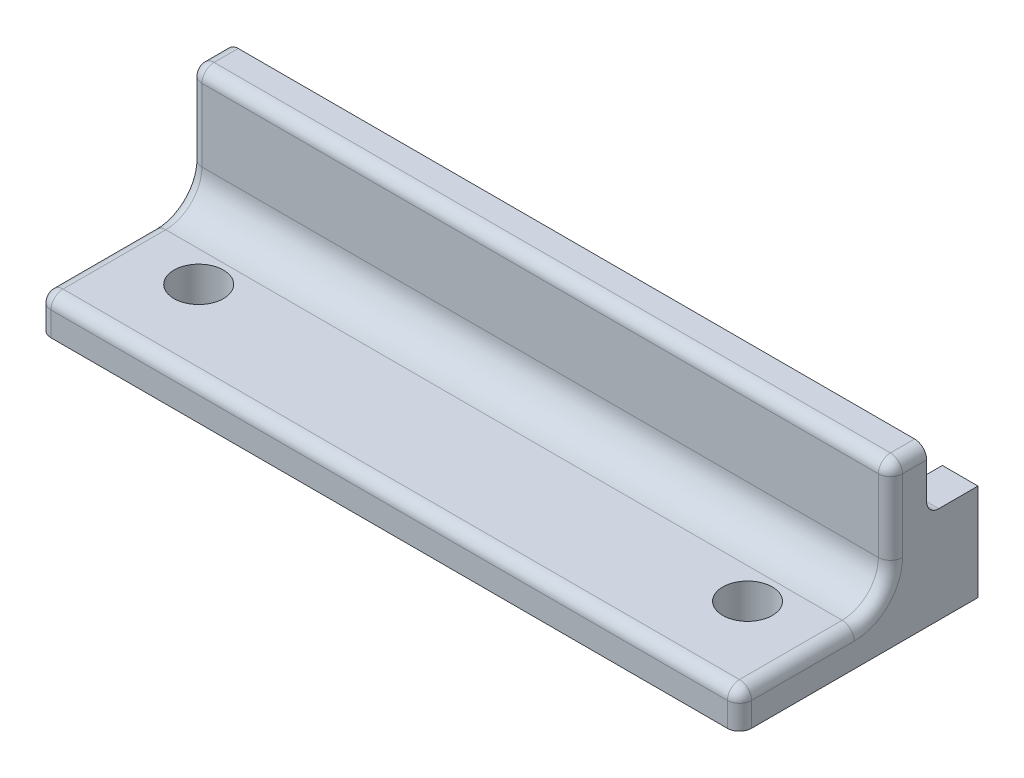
ISO-10303-21;
HEADER;
FILE_DESCRIPTION(('STEP AP214'),'2;1');
FILE_NAME('part.step','',(''),(''),'','','');
FILE_SCHEMA(('AUTOMOTIVE_DESIGN { 1 0 10303 214 1 1 1 1 }'));
ENDSEC;
DATA;
#1=APPLICATION_CONTEXT('core data for automotive mechanical design processes');
#2=APPLICATION_PROTOCOL_DEFINITION('international standard','automotive_design',2000,#1);
#3=PRODUCT_CONTEXT('',#1,'mechanical');
#4=PRODUCT('Part','Part','',(#3));
#5=PRODUCT_RELATED_PRODUCT_CATEGORY('part','',(#4));
#6=PRODUCT_DEFINITION_FORMATION('','',#4);
#7=PRODUCT_DEFINITION_CONTEXT('part definition',#1,'design');
#8=PRODUCT_DEFINITION('design','',#6,#7);
#9=PRODUCT_DEFINITION_SHAPE('','',#8);
#10=(LENGTH_UNIT() NAMED_UNIT(*) SI_UNIT(.MILLI.,.METRE.));
#11=(NAMED_UNIT(*) PLANE_ANGLE_UNIT() SI_UNIT($,.RADIAN.));
#12=(NAMED_UNIT(*) SI_UNIT($,.STERADIAN.) SOLID_ANGLE_UNIT());
#13=UNCERTAINTY_MEASURE_WITH_UNIT(LENGTH_MEASURE(1.E-05),#10,'distance_accuracy_value','');
#14=(GEOMETRIC_REPRESENTATION_CONTEXT(3) GLOBAL_UNCERTAINTY_ASSIGNED_CONTEXT((#13)) GLOBAL_UNIT_ASSIGNED_CONTEXT((#10,
#11,#12)) REPRESENTATION_CONTEXT('',''));
#15=CARTESIAN_POINT('',(0.,0.,0.));
#16=DIRECTION('',(0.,0.,1.));
#17=DIRECTION('',(1.,0.,0.));
#18=AXIS2_PLACEMENT_3D('',#15,#16,#17);
#19=CARTESIAN_POINT('',(46.400352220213,6.65930996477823,3.));
#20=DIRECTION('',(1.,0.,0.));
#21=DIRECTION('',(0.,1.,0.));
#22=AXIS2_PLACEMENT_3D('',#19,#20,#21);
#23=PLANE('',#22);
#24=DIRECTION('',(0.,-1.,0.));
#25=VECTOR('',#24,1.);
#26=CARTESIAN_POINT('',(46.400352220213,6.65930996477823,0.));
#27=LINE('',#26,#25);
#28=CARTESIAN_POINT('',(46.400352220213,5.65930996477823,0.));
#29=VERTEX_POINT('',#28);
#30=CARTESIAN_POINT('',(46.400352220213,2.65930996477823,0.));
#31=VERTEX_POINT('',#30);
#32=EDGE_CURVE('E306',#29,#31,#27,.T.);
#33=ORIENTED_EDGE('',*,*,#32,.F.);
#34=DIRECTION('',(0.,0.,-1.));
#35=VECTOR('',#34,1.);
#36=CARTESIAN_POINT('',(46.400352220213,5.65930996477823,2.));
#37=LINE('',#36,#35);
#38=CARTESIAN_POINT('',(46.400352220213,5.65930996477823,2.));
#39=VERTEX_POINT('',#38);
#40=EDGE_CURVE('E421',#29,#39,#37,.F.);
#41=ORIENTED_EDGE('',*,*,#40,.T.);
#42=DIRECTION('',(0.,-1.,0.));
#43=VECTOR('',#42,1.);
#44=CARTESIAN_POINT('',(46.400352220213,6.65930996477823,2.));
#45=LINE('',#44,#43);
#46=CARTESIAN_POINT('',(46.400352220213,-0.340690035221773,2.));
#47=VERTEX_POINT('',#46);
#48=EDGE_CURVE('E418',#39,#47,#45,.T.);
#49=ORIENTED_EDGE('',*,*,#48,.T.);
#50=CARTESIAN_POINT('',(46.400352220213,-0.340690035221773,6.));
#51=DIRECTION('',(1.,0.,0.));
#52=DIRECTION('',(0.,1.,0.));
#53=AXIS2_PLACEMENT_3D('',#50,#51,#52);
#54=CIRCLE('',#53,4.);
#55=CARTESIAN_POINT('',(46.400352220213,-4.34069003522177,6.));
#56=VERTEX_POINT('',#55);
#57=EDGE_CURVE('E415',#47,#56,#54,.F.);
#58=ORIENTED_EDGE('',*,*,#57,.T.);
#59=DIRECTION('',(0.,0.,1.));
#60=VECTOR('',#59,1.);
#61=CARTESIAN_POINT('',(46.400352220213,-4.34069003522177,14.5));
#62=LINE('',#61,#60);
#63=CARTESIAN_POINT('',(46.400352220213,-4.34069003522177,14.5));
#64=VERTEX_POINT('',#63);
#65=EDGE_CURVE('E409',#56,#64,#62,.T.);
#66=ORIENTED_EDGE('',*,*,#65,.T.);
#67=DIRECTION('',(0.,1.,0.));
#68=VECTOR('',#67,1.);
#69=CARTESIAN_POINT('',(46.400352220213,-6.34069003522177,14.5));
#70=LINE('',#69,#68);
#71=CARTESIAN_POINT('',(46.400352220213,-6.34069003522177,14.5));
#72=VERTEX_POINT('',#71);
#73=EDGE_CURVE('E412',#64,#72,#70,.F.);
#74=ORIENTED_EDGE('',*,*,#73,.T.);
#75=DIRECTION('',(0.,0.,1.));
#76=VECTOR('',#75,1.);
#77=CARTESIAN_POINT('',(46.400352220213,-6.34069003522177,0.));
#78=LINE('',#77,#76);
#79=CARTESIAN_POINT('',(46.400352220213,-6.34069003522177,-4.25000000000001));
#80=VERTEX_POINT('',#79);
#81=EDGE_CURVE('E282',#80,#72,#78,.T.);
#82=ORIENTED_EDGE('',*,*,#81,.F.);
#83=DIRECTION('',(0.,-1.,0.));
#84=VECTOR('',#83,1.);
#85=CARTESIAN_POINT('',(46.400352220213,1.65930996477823,-4.25000000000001));
#86=LINE('',#85,#84);
#87=CARTESIAN_POINT('',(46.400352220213,1.65930996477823,-4.25000000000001));
#88=VERTEX_POINT('',#87);
#89=EDGE_CURVE('E210',#88,#80,#86,.T.);
#90=ORIENTED_EDGE('',*,*,#89,.F.);
#91=DIRECTION('',(0.,0.,1.));
#92=VECTOR('',#91,1.);
#93=CARTESIAN_POINT('',(46.400352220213,1.65930996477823,0.));
#94=LINE('',#93,#92);
#95=CARTESIAN_POINT('',(46.400352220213,1.65930996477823,-1.));
#96=VERTEX_POINT('',#95);
#97=EDGE_CURVE('E211',#88,#96,#94,.T.);
#98=ORIENTED_EDGE('',*,*,#97,.T.);
#99=CARTESIAN_POINT('',(46.400352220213,2.65930996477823,-1.));
#100=DIRECTION('',(1.,0.,0.));
#101=DIRECTION('',(0.,1.,0.));
#102=AXIS2_PLACEMENT_3D('',#99,#100,#101);
#103=CIRCLE('',#102,1.);
#104=EDGE_CURVE('E11',#96,#31,#103,.F.);
#105=ORIENTED_EDGE('',*,*,#104,.T.);
#106=EDGE_LOOP('',(#33,#41,#49,#58,#66,#74,#82,#90,#98,#105));
#107=FACE_BOUND('',#106,.T.);
#108=ADVANCED_FACE('F41',(#107),#23,.T.);
#109=CARTESIAN_POINT('',(46.400352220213,6.65930996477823,3.));
#110=DIRECTION('',(0.,-1.,0.));
#111=DIRECTION('',(1.,0.,0.));
#112=AXIS2_PLACEMENT_3D('',#109,#110,#111);
#113=PLANE('',#112);
#114=DIRECTION('',(-1.,0.,0.));
#115=VECTOR('',#114,1.);
#116=CARTESIAN_POINT('',(46.400352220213,6.65930996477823,2.));
#117=LINE('',#116,#115);
#118=CARTESIAN_POINT('',(-10.599647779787,6.65930996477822,2.));
#119=VERTEX_POINT('',#118);
#120=CARTESIAN_POINT('',(45.400352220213,6.65930996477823,2.));
#121=VERTEX_POINT('',#120);
#122=EDGE_CURVE('E327',#119,#121,#117,.F.);
#123=ORIENTED_EDGE('',*,*,#122,.T.);
#124=DIRECTION('',(0.,0.,-1.));
#125=VECTOR('',#124,1.);
#126=CARTESIAN_POINT('',(45.400352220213,6.65930996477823,0.));
#127=LINE('',#126,#125);
#128=CARTESIAN_POINT('',(45.400352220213,6.65930996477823,0.));
#129=VERTEX_POINT('',#128);
#130=EDGE_CURVE('E379',#121,#129,#127,.T.);
#131=ORIENTED_EDGE('',*,*,#130,.T.);
#132=DIRECTION('',(-1.,0.,0.));
#133=VECTOR('',#132,1.);
#134=CARTESIAN_POINT('',(46.400352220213,6.65930996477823,0.));
#135=LINE('',#134,#133);
#136=CARTESIAN_POINT('',(-10.599647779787,6.65930996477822,0.));
#137=VERTEX_POINT('',#136);
#138=EDGE_CURVE('E303',#129,#137,#135,.T.);
#139=ORIENTED_EDGE('',*,*,#138,.T.);
#140=DIRECTION('',(0.,0.,-1.));
#141=VECTOR('',#140,1.);
#142=CARTESIAN_POINT('',(-10.599647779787,6.65930996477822,3.));
#143=LINE('',#142,#141);
#144=EDGE_CURVE('E362',#137,#119,#143,.F.);
#145=ORIENTED_EDGE('',*,*,#144,.T.);
#146=EDGE_LOOP('',(#123,#131,#139,#145));
#147=FACE_BOUND('',#146,.T.);
#148=ADVANCED_FACE('F571',(#147),#113,.F.);
#149=CARTESIAN_POINT('',(-11.599647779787,6.65930996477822,3.));
#150=DIRECTION('',(1.,0.,0.));
#151=DIRECTION('',(0.,0.,-1.));
#152=AXIS2_PLACEMENT_3D('',#149,#150,#151);
#153=PLANE('',#152);
#154=DIRECTION('',(0.,0.,-1.));
#155=VECTOR('',#154,1.);
#156=CARTESIAN_POINT('',(-11.599647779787,-6.34069003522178,0.));
#157=LINE('',#156,#155);
#158=CARTESIAN_POINT('',(-11.599647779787,-6.34069003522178,14.5));
#159=VERTEX_POINT('',#158);
#160=CARTESIAN_POINT('',(-11.599647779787,-6.34069003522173,-4.25000000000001));
#161=VERTEX_POINT('',#160);
#162=EDGE_CURVE('E292',#159,#161,#157,.T.);
#163=ORIENTED_EDGE('',*,*,#162,.F.);
#164=DIRECTION('',(0.,1.,0.));
#165=VECTOR('',#164,1.);
#166=CARTESIAN_POINT('',(-11.599647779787,6.65930996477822,14.5));
#167=LINE('',#166,#165);
#168=CARTESIAN_POINT('',(-11.599647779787,-4.34069003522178,14.5));
#169=VERTEX_POINT('',#168);
#170=EDGE_CURVE('E343',#159,#169,#167,.T.);
#171=ORIENTED_EDGE('',*,*,#170,.T.);
#172=DIRECTION('',(0.,0.,-1.));
#173=VECTOR('',#172,1.);
#174=CARTESIAN_POINT('',(-11.599647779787,-4.34069003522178,3.));
#175=LINE('',#174,#173);
#176=CARTESIAN_POINT('',(-11.599647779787,-4.34069003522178,6.));
#177=VERTEX_POINT('',#176);
#178=EDGE_CURVE('E331',#169,#177,#175,.T.);
#179=ORIENTED_EDGE('',*,*,#178,.T.);
#180=CARTESIAN_POINT('',(-11.599647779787,-0.340690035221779,6.));
#181=DIRECTION('',(1.,0.,0.));
#182=DIRECTION('',(0.,0.,-1.));
#183=AXIS2_PLACEMENT_3D('',#180,#181,#182);
#184=CIRCLE('',#183,4.);
#185=CARTESIAN_POINT('',(-11.599647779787,-0.340690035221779,2.));
#186=VERTEX_POINT('',#185);
#187=EDGE_CURVE('E334',#177,#186,#184,.T.);
#188=ORIENTED_EDGE('',*,*,#187,.T.);
#189=DIRECTION('',(0.,-1.,0.));
#190=VECTOR('',#189,1.);
#191=CARTESIAN_POINT('',(-11.599647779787,5.65930996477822,2.));
#192=LINE('',#191,#190);
#193=CARTESIAN_POINT('',(-11.599647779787,5.65930996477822,2.));
#194=VERTEX_POINT('',#193);
#195=EDGE_CURVE('E337',#186,#194,#192,.F.);
#196=ORIENTED_EDGE('',*,*,#195,.T.);
#197=DIRECTION('',(0.,0.,-1.));
#198=VECTOR('',#197,1.);
#199=CARTESIAN_POINT('',(-11.599647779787,5.65930996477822,3.));
#200=LINE('',#199,#198);
#201=CARTESIAN_POINT('',(-11.599647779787,5.65930996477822,0.));
#202=VERTEX_POINT('',#201);
#203=EDGE_CURVE('E340',#194,#202,#200,.T.);
#204=ORIENTED_EDGE('',*,*,#203,.T.);
#205=DIRECTION('',(0.,-1.,0.));
#206=VECTOR('',#205,1.);
#207=CARTESIAN_POINT('',(-11.599647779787,6.65930996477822,0.));
#208=LINE('',#207,#206);
#209=CARTESIAN_POINT('',(-11.599647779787,2.65930996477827,0.));
#210=VERTEX_POINT('',#209);
#211=EDGE_CURVE('E299',#202,#210,#208,.T.);
#212=ORIENTED_EDGE('',*,*,#211,.T.);
#213=CARTESIAN_POINT('',(-11.599647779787,2.65930996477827,-1.));
#214=DIRECTION('',(1.,0.,0.));
#215=DIRECTION('',(0.,0.,-1.));
#216=AXIS2_PLACEMENT_3D('',#213,#214,#215);
#217=CIRCLE('',#216,1.);
#218=CARTESIAN_POINT('',(-11.599647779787,1.65930996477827,-1.));
#219=VERTEX_POINT('',#218);
#220=EDGE_CURVE('E482',#210,#219,#217,.T.);
#221=ORIENTED_EDGE('',*,*,#220,.T.);
#222=DIRECTION('',(0.,0.,-1.));
#223=VECTOR('',#222,1.);
#224=CARTESIAN_POINT('',(-11.599647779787,1.65930996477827,0.));
#225=LINE('',#224,#223);
#226=CARTESIAN_POINT('',(-11.599647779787,1.65930996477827,-4.25000000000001));
#227=VERTEX_POINT('',#226);
#228=EDGE_CURVE('E235',#219,#227,#225,.T.);
#229=ORIENTED_EDGE('',*,*,#228,.T.);
#230=DIRECTION('',(0.,-1.,0.));
#231=VECTOR('',#230,1.);
#232=CARTESIAN_POINT('',(-11.599647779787,1.65930996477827,-4.25000000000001));
#233=LINE('',#232,#231);
#234=EDGE_CURVE('E253',#227,#161,#233,.T.);
#235=ORIENTED_EDGE('',*,*,#234,.T.);
#236=EDGE_LOOP('',(#163,#171,#179,#188,#196,#204,#212,#221,#229,#235));
#237=FACE_BOUND('',#236,.T.);
#238=ADVANCED_FACE('F521',(#237),#153,.F.);
#239=CARTESIAN_POINT('',(0.,0.,3.));
#240=DIRECTION('',(0.,0.,1.));
#241=DIRECTION('',(1.,0.,0.));
#242=AXIS2_PLACEMENT_3D('',#239,#240,#241);
#243=PLANE('',#242);
#244=DIRECTION('',(-1.,0.,0.));
#245=VECTOR('',#244,1.);
#246=CARTESIAN_POINT('',(0.,-0.340690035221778,3.));
#247=LINE('',#246,#245);
#248=CARTESIAN_POINT('',(-10.599647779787,-0.340690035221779,3.));
#249=VERTEX_POINT('',#248);
#250=CARTESIAN_POINT('',(45.400352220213,-0.340690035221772,3.));
#251=VERTEX_POINT('',#250);
#252=EDGE_CURVE('E313',#249,#251,#247,.F.);
#253=ORIENTED_EDGE('',*,*,#252,.T.);
#254=DIRECTION('',(0.,-1.,0.));
#255=VECTOR('',#254,1.);
#256=CARTESIAN_POINT('',(45.400352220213,0.,3.));
#257=LINE('',#256,#255);
#258=CARTESIAN_POINT('',(45.400352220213,5.65930996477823,3.));
#259=VERTEX_POINT('',#258);
#260=EDGE_CURVE('E427',#251,#259,#257,.F.);
#261=ORIENTED_EDGE('',*,*,#260,.T.);
#262=DIRECTION('',(-1.,0.,0.));
#263=VECTOR('',#262,1.);
#264=CARTESIAN_POINT('',(-11.599647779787,5.65930996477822,3.));
#265=LINE('',#264,#263);
#266=CARTESIAN_POINT('',(-10.599647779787,5.65930996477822,3.));
#267=VERTEX_POINT('',#266);
#268=EDGE_CURVE('E324',#259,#267,#265,.T.);
#269=ORIENTED_EDGE('',*,*,#268,.T.);
#270=DIRECTION('',(0.,-1.,0.));
#271=VECTOR('',#270,1.);
#272=CARTESIAN_POINT('',(-10.599647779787,-0.340690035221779,3.));
#273=LINE('',#272,#271);
#274=EDGE_CURVE('E369',#267,#249,#273,.T.);
#275=ORIENTED_EDGE('',*,*,#274,.T.);
#276=EDGE_LOOP('',(#253,#261,#269,#275));
#277=FACE_BOUND('',#276,.T.);
#278=ADVANCED_FACE('F615',(#277),#243,.T.);
#279=CARTESIAN_POINT('',(0.,0.,0.));
#280=DIRECTION('',(0.,0.,1.));
#281=DIRECTION('',(1.,0.,0.));
#282=AXIS2_PLACEMENT_3D('',#279,#280,#281);
#283=PLANE('',#282);
#284=CARTESIAN_POINT('',(-3.69964777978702,1.65930996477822,0.));
#285=DIRECTION('',(0.,0.,1.));
#286=DIRECTION('',(1.,0.,0.));
#287=AXIS2_PLACEMENT_3D('',#284,#285,#286);
#288=CIRCLE('',#287,1.2);
#289=CARTESIAN_POINT('',(-2.49964777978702,1.65930996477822,0.));
#290=VERTEX_POINT('',#289);
#291=EDGE_CURVE('E471',#290,#290,#288,.F.);
#292=ORIENTED_EDGE('',*,*,#291,.F.);
#293=EDGE_LOOP('',(#292));
#294=FACE_BOUND('',#293,.T.);
#295=CARTESIAN_POINT('',(38.500352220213,1.65930996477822,0.));
#296=DIRECTION('',(0.,0.,1.));
#297=DIRECTION('',(1.,0.,0.));
#298=AXIS2_PLACEMENT_3D('',#295,#296,#297);
#299=CIRCLE('',#298,1.2);
#300=CARTESIAN_POINT('',(39.700352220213,1.65930996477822,0.));
#301=VERTEX_POINT('',#300);
#302=EDGE_CURVE('E445',#301,#301,#299,.F.);
#303=ORIENTED_EDGE('',*,*,#302,.F.);
#304=EDGE_LOOP('',(#303));
#305=FACE_BOUND('',#304,.T.);
#306=ORIENTED_EDGE('',*,*,#32,.T.);
#307=DIRECTION('',(-1.,0.,0.));
#308=VECTOR('',#307,1.);
#309=CARTESIAN_POINT('',(43.450352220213,2.65930996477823,0.));
#310=LINE('',#309,#308);
#311=CARTESIAN_POINT('',(43.450352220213,2.65930996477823,0.));
#312=VERTEX_POINT('',#311);
#313=EDGE_CURVE('E489',#31,#312,#310,.T.);
#314=ORIENTED_EDGE('',*,*,#313,.T.);
#315=DIRECTION('',(0.,-1.,0.));
#316=VECTOR('',#315,1.);
#317=CARTESIAN_POINT('',(43.450352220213,1.65930996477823,0.));
#318=LINE('',#317,#316);
#319=CARTESIAN_POINT('',(43.450352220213,-6.34069003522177,0.));
#320=VERTEX_POINT('',#319);
#321=EDGE_CURVE('E224',#312,#320,#318,.T.);
#322=ORIENTED_EDGE('',*,*,#321,.T.);
#323=DIRECTION('',(1.,0.,0.));
#324=VECTOR('',#323,1.);
#325=CARTESIAN_POINT('',(46.400352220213,-6.34069003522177,0.));
#326=LINE('',#325,#324);
#327=CARTESIAN_POINT('',(-8.649647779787,-6.34069003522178,0.));
#328=VERTEX_POINT('',#327);
#329=EDGE_CURVE('E295',#328,#320,#326,.T.);
#330=ORIENTED_EDGE('',*,*,#329,.F.);
#331=DIRECTION('',(0.,-1.,0.));
#332=VECTOR('',#331,1.);
#333=CARTESIAN_POINT('',(-8.64964777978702,1.65930996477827,0.));
#334=LINE('',#333,#332);
#335=CARTESIAN_POINT('',(-8.64964777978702,2.65930996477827,0.));
#336=VERTEX_POINT('',#335);
#337=EDGE_CURVE('E243',#336,#328,#334,.T.);
#338=ORIENTED_EDGE('',*,*,#337,.F.);
#339=DIRECTION('',(-1.,0.,0.));
#340=VECTOR('',#339,1.);
#341=CARTESIAN_POINT('',(0.,2.65930996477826,0.));
#342=LINE('',#341,#340);
#343=EDGE_CURVE('E475',#336,#210,#342,.T.);
#344=ORIENTED_EDGE('',*,*,#343,.T.);
#345=ORIENTED_EDGE('',*,*,#211,.F.);
#346=CARTESIAN_POINT('',(-10.599647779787,5.65930996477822,0.));
#347=DIRECTION('',(0.,0.,1.));
#348=DIRECTION('',(1.,0.,0.));
#349=AXIS2_PLACEMENT_3D('',#346,#347,#348);
#350=CIRCLE('',#349,1.);
#351=EDGE_CURVE('E358',#202,#137,#350,.F.);
#352=ORIENTED_EDGE('',*,*,#351,.T.);
#353=ORIENTED_EDGE('',*,*,#138,.F.);
#354=CARTESIAN_POINT('',(45.400352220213,5.65930996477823,0.));
#355=DIRECTION('',(0.,0.,1.));
#356=DIRECTION('',(1.,0.,0.));
#357=AXIS2_PLACEMENT_3D('',#354,#355,#356);
#358=CIRCLE('',#357,1.);
#359=EDGE_CURVE('E406',#129,#29,#358,.F.);
#360=ORIENTED_EDGE('',*,*,#359,.T.);
#361=EDGE_LOOP('',(#306,#314,#322,#330,#338,#344,#345,#352,#353,#360));
#362=FACE_BOUND('',#361,.T.);
#363=ADVANCED_FACE('F497',(#294,#305,#362),#283,.F.);
#364=CARTESIAN_POINT('',(0.,-3.34069003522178,0.));
#365=DIRECTION('',(0.,-1.,0.));
#366=DIRECTION('',(1.,0.,0.));
#367=AXIS2_PLACEMENT_3D('',#364,#365,#366);
#368=PLANE('',#367);
#369=CARTESIAN_POINT('',(40.120352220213,-3.34069003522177,8.54895473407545));
#370=DIRECTION('',(0.,-1.,0.));
#371=DIRECTION('',(1.,0.,0.));
#372=AXIS2_PLACEMENT_3D('',#369,#370,#371);
#373=CIRCLE('',#372,2.05);
#374=CARTESIAN_POINT('',(42.170352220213,-3.34069003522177,8.54895473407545));
#375=VERTEX_POINT('',#374);
#376=EDGE_CURVE('E272',#375,#375,#373,.T.);
#377=ORIENTED_EDGE('',*,*,#376,.T.);
#378=EDGE_LOOP('',(#377));
#379=FACE_BOUND('',#378,.T.);
#380=CARTESIAN_POINT('',(-5.31964777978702,-3.34069003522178,8.54895473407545));
#381=DIRECTION('',(0.,-1.,0.));
#382=DIRECTION('',(1.,0.,0.));
#383=AXIS2_PLACEMENT_3D('',#380,#381,#382);
#384=CIRCLE('',#383,2.05);
#385=CARTESIAN_POINT('',(-3.26964777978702,-3.34069003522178,8.54895473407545));
#386=VERTEX_POINT('',#385);
#387=EDGE_CURVE('E273',#386,#386,#384,.T.);
#388=ORIENTED_EDGE('',*,*,#387,.T.);
#389=EDGE_LOOP('',(#388));
#390=FACE_BOUND('',#389,.T.);
#391=DIRECTION('',(-1.,0.,0.));
#392=VECTOR('',#391,1.);
#393=CARTESIAN_POINT('',(0.,-3.34069003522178,14.5));
#394=LINE('',#393,#392);
#395=CARTESIAN_POINT('',(-10.599647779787,-3.34069003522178,14.5));
#396=VERTEX_POINT('',#395);
#397=CARTESIAN_POINT('',(45.400352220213,-3.34069003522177,14.5));
#398=VERTEX_POINT('',#397);
#399=EDGE_CURVE('E320',#396,#398,#394,.F.);
#400=ORIENTED_EDGE('',*,*,#399,.T.);
#401=DIRECTION('',(0.,0.,1.));
#402=VECTOR('',#401,1.);
#403=CARTESIAN_POINT('',(45.400352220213,-3.34069003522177,6.));
#404=LINE('',#403,#402);
#405=CARTESIAN_POINT('',(45.400352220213,-3.34069003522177,6.));
#406=VERTEX_POINT('',#405);
#407=EDGE_CURVE('E442',#398,#406,#404,.F.);
#408=ORIENTED_EDGE('',*,*,#407,.T.);
#409=DIRECTION('',(-1.,0.,0.));
#410=VECTOR('',#409,1.);
#411=CARTESIAN_POINT('',(0.,-3.34069003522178,6.));
#412=LINE('',#411,#410);
#413=CARTESIAN_POINT('',(-10.599647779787,-3.34069003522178,6.));
#414=VERTEX_POINT('',#413);
#415=EDGE_CURVE('E310',#406,#414,#412,.T.);
#416=ORIENTED_EDGE('',*,*,#415,.T.);
#417=DIRECTION('',(0.,0.,-1.));
#418=VECTOR('',#417,1.);
#419=CARTESIAN_POINT('',(-10.599647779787,-3.34069003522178,0.));
#420=LINE('',#419,#418);
#421=EDGE_CURVE('E376',#414,#396,#420,.F.);
#422=ORIENTED_EDGE('',*,*,#421,.T.);
#423=EDGE_LOOP('',(#400,#408,#416,#422));
#424=FACE_BOUND('',#423,.T.);
#425=ADVANCED_FACE('F609',(#379,#390,#424),#368,.F.);
#426=CARTESIAN_POINT('',(0.,-6.34069003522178,0.));
#427=DIRECTION('',(0.,-1.,0.));
#428=DIRECTION('',(1.,0.,0.));
#429=AXIS2_PLACEMENT_3D('',#426,#427,#428);
#430=PLANE('',#429);
#431=CARTESIAN_POINT('',(40.120352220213,-6.34069003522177,8.54895473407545));
#432=DIRECTION('',(0.,-1.,0.));
#433=DIRECTION('',(1.,0.,0.));
#434=AXIS2_PLACEMENT_3D('',#431,#432,#433);
#435=CIRCLE('',#434,2.05);
#436=CARTESIAN_POINT('',(42.170352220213,-6.34069003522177,8.54895473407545));
#437=VERTEX_POINT('',#436);
#438=EDGE_CURVE('E278',#437,#437,#435,.T.);
#439=ORIENTED_EDGE('',*,*,#438,.F.);
#440=EDGE_LOOP('',(#439));
#441=FACE_BOUND('',#440,.T.);
#442=ORIENTED_EDGE('',*,*,#81,.T.);
#443=CARTESIAN_POINT('',(45.400352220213,-6.34069003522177,14.5));
#444=DIRECTION('',(0.,-1.,0.));
#445=DIRECTION('',(1.,0.,0.));
#446=AXIS2_PLACEMENT_3D('',#443,#444,#445);
#447=CIRCLE('',#446,1.);
#448=CARTESIAN_POINT('',(45.400352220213,-6.34069003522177,15.5));
#449=VERTEX_POINT('',#448);
#450=EDGE_CURVE('E436',#72,#449,#447,.T.);
#451=ORIENTED_EDGE('',*,*,#450,.T.);
#452=DIRECTION('',(-1.,0.,0.));
#453=VECTOR('',#452,1.);
#454=CARTESIAN_POINT('',(46.400352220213,-6.34069003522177,15.5));
#455=LINE('',#454,#453);
#456=CARTESIAN_POINT('',(-10.599647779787,-6.34069003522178,15.5));
#457=VERTEX_POINT('',#456);
#458=EDGE_CURVE('E289',#449,#457,#455,.T.);
#459=ORIENTED_EDGE('',*,*,#458,.T.);
#460=CARTESIAN_POINT('',(-10.599647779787,-6.34069003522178,14.5));
#461=DIRECTION('',(0.,-1.,0.));
#462=DIRECTION('',(1.,0.,0.));
#463=AXIS2_PLACEMENT_3D('',#460,#461,#462);
#464=CIRCLE('',#463,1.);
#465=EDGE_CURVE('E351',#457,#159,#464,.T.);
#466=ORIENTED_EDGE('',*,*,#465,.T.);
#467=ORIENTED_EDGE('',*,*,#162,.T.);
#468=DIRECTION('',(1.,0.,0.));
#469=VECTOR('',#468,1.);
#470=CARTESIAN_POINT('',(-8.64964777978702,-6.34069003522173,-4.25000000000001));
#471=LINE('',#470,#469);
#472=CARTESIAN_POINT('',(-8.64964777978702,-6.34069003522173,-4.25000000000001));
#473=VERTEX_POINT('',#472);
#474=EDGE_CURVE('E236',#161,#473,#471,.T.);
#475=ORIENTED_EDGE('',*,*,#474,.T.);
#476=DIRECTION('',(0.,0.,1.));
#477=VECTOR('',#476,1.);
#478=CARTESIAN_POINT('',(-8.64964777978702,-6.34069003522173,0.));
#479=LINE('',#478,#477);
#480=EDGE_CURVE('E228',#473,#328,#479,.T.);
#481=ORIENTED_EDGE('',*,*,#480,.T.);
#482=ORIENTED_EDGE('',*,*,#329,.T.);
#483=DIRECTION('',(0.,0.,-1.));
#484=VECTOR('',#483,1.);
#485=CARTESIAN_POINT('',(43.450352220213,-6.34069003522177,0.));
#486=LINE('',#485,#484);
#487=CARTESIAN_POINT('',(43.450352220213,-6.34069003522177,-4.25000000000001));
#488=VERTEX_POINT('',#487);
#489=EDGE_CURVE('E219',#320,#488,#486,.T.);
#490=ORIENTED_EDGE('',*,*,#489,.T.);
#491=DIRECTION('',(1.,0.,0.));
#492=VECTOR('',#491,1.);
#493=CARTESIAN_POINT('',(43.450352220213,-6.34069003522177,-4.25000000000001));
#494=LINE('',#493,#492);
#495=EDGE_CURVE('E201',#488,#80,#494,.T.);
#496=ORIENTED_EDGE('',*,*,#495,.T.);
#497=EDGE_LOOP('',(#442,#451,#459,#466,#467,#475,#481,#482,#490,#496));
#498=FACE_BOUND('',#497,.T.);
#499=CARTESIAN_POINT('',(-5.31964777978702,-6.34069003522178,8.54895473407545));
#500=DIRECTION('',(0.,-1.,0.));
#501=DIRECTION('',(1.,0.,0.));
#502=AXIS2_PLACEMENT_3D('',#499,#500,#501);
#503=CIRCLE('',#502,2.05);
#504=CARTESIAN_POINT('',(-3.26964777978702,-6.34069003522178,8.54895473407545));
#505=VERTEX_POINT('',#504);
#506=EDGE_CURVE('E268',#505,#505,#503,.T.);
#507=ORIENTED_EDGE('',*,*,#506,.F.);
#508=EDGE_LOOP('',(#507));
#509=FACE_BOUND('',#508,.T.);
#510=ADVANCED_FACE('F505',(#441,#498,#509),#430,.T.);
#511=CARTESIAN_POINT('',(46.400352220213,-6.34069003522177,15.5));
#512=DIRECTION('',(0.,0.,-1.));
#513=DIRECTION('',(-1.,0.,0.));
#514=AXIS2_PLACEMENT_3D('',#511,#512,#513);
#515=PLANE('',#514);
#516=ORIENTED_EDGE('',*,*,#458,.F.);
#517=DIRECTION('',(0.,1.,0.));
#518=VECTOR('',#517,1.);
#519=CARTESIAN_POINT('',(45.400352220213,-4.34069003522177,15.5));
#520=LINE('',#519,#518);
#521=CARTESIAN_POINT('',(45.400352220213,-4.34069003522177,15.5));
#522=VERTEX_POINT('',#521);
#523=EDGE_CURVE('E433',#449,#522,#520,.T.);
#524=ORIENTED_EDGE('',*,*,#523,.T.);
#525=DIRECTION('',(-1.,0.,0.));
#526=VECTOR('',#525,1.);
#527=CARTESIAN_POINT('',(46.400352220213,-4.34069003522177,15.5));
#528=LINE('',#527,#526);
#529=CARTESIAN_POINT('',(-10.599647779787,-4.34069003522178,15.5));
#530=VERTEX_POINT('',#529);
#531=EDGE_CURVE('E317',#522,#530,#528,.T.);
#532=ORIENTED_EDGE('',*,*,#531,.T.);
#533=DIRECTION('',(0.,1.,0.));
#534=VECTOR('',#533,1.);
#535=CARTESIAN_POINT('',(-10.599647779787,-6.34069003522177,15.5));
#536=LINE('',#535,#534);
#537=EDGE_CURVE('E347',#530,#457,#536,.F.);
#538=ORIENTED_EDGE('',*,*,#537,.T.);
#539=EDGE_LOOP('',(#516,#524,#532,#538));
#540=FACE_BOUND('',#539,.T.);
#541=ADVANCED_FACE('F603',(#540),#515,.F.);
#542=CARTESIAN_POINT('',(40.120352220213,-6.34069003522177,8.54895473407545));
#543=DIRECTION('',(0.,1.,0.));
#544=DIRECTION('',(-1.,0.,0.));
#545=AXIS2_PLACEMENT_3D('',#542,#543,#544);
#546=CYLINDRICAL_SURFACE('',#545,2.05);
#547=ORIENTED_EDGE('',*,*,#438,.T.);
#548=EDGE_LOOP('',(#547));
#549=FACE_BOUND('',#548,.T.);
#550=ORIENTED_EDGE('',*,*,#376,.F.);
#551=EDGE_LOOP('',(#550));
#552=FACE_BOUND('',#551,.T.);
#553=ADVANCED_FACE('F704',(#549,#552),#546,.F.);
#554=CARTESIAN_POINT('',(-5.31964777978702,-6.34069003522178,8.54895473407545));
#555=DIRECTION('',(0.,1.,0.));
#556=DIRECTION('',(-1.,0.,0.));
#557=AXIS2_PLACEMENT_3D('',#554,#555,#556);
#558=CYLINDRICAL_SURFACE('',#557,2.05);
#559=ORIENTED_EDGE('',*,*,#506,.T.);
#560=EDGE_LOOP('',(#559));
#561=FACE_BOUND('',#560,.T.);
#562=ORIENTED_EDGE('',*,*,#387,.F.);
#563=EDGE_LOOP('',(#562));
#564=FACE_BOUND('',#563,.T.);
#565=ADVANCED_FACE('F635',(#561,#564),#558,.F.);
#566=CARTESIAN_POINT('',(0.,-0.340690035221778,6.));
#567=DIRECTION('',(-1.,0.,0.));
#568=DIRECTION('',(0.,-1.,0.));
#569=AXIS2_PLACEMENT_3D('',#566,#567,#568);
#570=CYLINDRICAL_SURFACE('',#569,3.);
#571=ORIENTED_EDGE('',*,*,#415,.F.);
#572=CARTESIAN_POINT('',(45.400352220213,-0.340690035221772,6.));
#573=DIRECTION('',(1.,0.,0.));
#574=DIRECTION('',(0.,1.,0.));
#575=AXIS2_PLACEMENT_3D('',#572,#573,#574);
#576=CIRCLE('',#575,3.);
#577=EDGE_CURVE('E430',#406,#251,#576,.T.);
#578=ORIENTED_EDGE('',*,*,#577,.T.);
#579=ORIENTED_EDGE('',*,*,#252,.F.);
#580=CARTESIAN_POINT('',(-10.599647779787,-0.340690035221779,6.));
#581=DIRECTION('',(1.,0.,0.));
#582=DIRECTION('',(0.,0.,-1.));
#583=AXIS2_PLACEMENT_3D('',#580,#581,#582);
#584=CIRCLE('',#583,3.);
#585=EDGE_CURVE('E372',#249,#414,#584,.F.);
#586=ORIENTED_EDGE('',*,*,#585,.T.);
#587=EDGE_LOOP('',(#571,#578,#579,#586));
#588=FACE_BOUND('',#587,.T.);
#589=ADVANCED_FACE('F613',(#588),#570,.F.);
#590=CARTESIAN_POINT('',(46.400352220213,-4.34069003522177,14.5));
#591=DIRECTION('',(-1.,0.,0.));
#592=DIRECTION('',(0.,-1.,0.));
#593=AXIS2_PLACEMENT_3D('',#590,#591,#592);
#594=CYLINDRICAL_SURFACE('',#593,1.);
#595=ORIENTED_EDGE('',*,*,#531,.F.);
#596=CARTESIAN_POINT('',(45.400352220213,-4.34069003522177,14.5));
#597=DIRECTION('',(-1.,0.,0.));
#598=DIRECTION('',(0.,-1.,0.));
#599=AXIS2_PLACEMENT_3D('',#596,#597,#598);
#600=CIRCLE('',#599,1.);
#601=EDGE_CURVE('E439',#522,#398,#600,.T.);
#602=ORIENTED_EDGE('',*,*,#601,.T.);
#603=ORIENTED_EDGE('',*,*,#399,.F.);
#604=CARTESIAN_POINT('',(-10.599647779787,-4.34069003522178,14.5));
#605=DIRECTION('',(-1.,0.,0.));
#606=DIRECTION('',(0.,-1.,0.));
#607=AXIS2_PLACEMENT_3D('',#604,#605,#606);
#608=CIRCLE('',#607,1.);
#609=EDGE_CURVE('E354',#396,#530,#608,.F.);
#610=ORIENTED_EDGE('',*,*,#609,.T.);
#611=EDGE_LOOP('',(#595,#602,#603,#610));
#612=FACE_BOUND('',#611,.T.);
#613=ADVANCED_FACE('F607',(#612),#594,.T.);
#614=CARTESIAN_POINT('',(0.,5.65930996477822,2.));
#615=DIRECTION('',(1.,0.,0.));
#616=DIRECTION('',(0.,1.,0.));
#617=AXIS2_PLACEMENT_3D('',#614,#615,#616);
#618=CYLINDRICAL_SURFACE('',#617,1.);
#619=ORIENTED_EDGE('',*,*,#268,.F.);
#620=CARTESIAN_POINT('',(45.400352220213,5.65930996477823,2.));
#621=DIRECTION('',(1.,0.,0.));
#622=DIRECTION('',(0.,1.,0.));
#623=AXIS2_PLACEMENT_3D('',#620,#621,#622);
#624=CIRCLE('',#623,1.);
#625=EDGE_CURVE('E424',#259,#121,#624,.F.);
#626=ORIENTED_EDGE('',*,*,#625,.T.);
#627=ORIENTED_EDGE('',*,*,#122,.F.);
#628=CARTESIAN_POINT('',(-10.599647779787,5.65930996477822,2.));
#629=DIRECTION('',(1.,0.,0.));
#630=DIRECTION('',(0.,1.,0.));
#631=AXIS2_PLACEMENT_3D('',#628,#629,#630);
#632=CIRCLE('',#631,1.);
#633=EDGE_CURVE('E365',#119,#267,#632,.T.);
#634=ORIENTED_EDGE('',*,*,#633,.T.);
#635=EDGE_LOOP('',(#619,#626,#627,#634));
#636=FACE_BOUND('',#635,.T.);
#637=ADVANCED_FACE('F566',(#636),#618,.T.);
#638=CARTESIAN_POINT('',(-10.599647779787,5.65930996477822,3.));
#639=DIRECTION('',(0.,0.,-1.));
#640=DIRECTION('',(-1.,0.,0.));
#641=AXIS2_PLACEMENT_3D('',#638,#639,#640);
#642=CYLINDRICAL_SURFACE('',#641,1.);
#643=CARTESIAN_POINT('',(-10.599647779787,5.65930996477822,2.));
#644=DIRECTION('',(0.,0.,1.));
#645=DIRECTION('',(1.,0.,0.));
#646=AXIS2_PLACEMENT_3D('',#643,#644,#645);
#647=CIRCLE('',#646,1.);
#648=EDGE_CURVE('E277',#119,#194,#647,.T.);
#649=ORIENTED_EDGE('',*,*,#648,.F.);
#650=ORIENTED_EDGE('',*,*,#144,.F.);
#651=ORIENTED_EDGE('',*,*,#351,.F.);
#652=ORIENTED_EDGE('',*,*,#203,.F.);
#653=EDGE_LOOP('',(#649,#650,#651,#652));
#654=FACE_BOUND('',#653,.T.);
#655=ADVANCED_FACE('F558',(#654),#642,.T.);
#656=CARTESIAN_POINT('',(-10.599647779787,5.65930996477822,2.));
#657=DIRECTION('',(1.,0.,0.));
#658=DIRECTION('',(0.,0.,-1.));
#659=AXIS2_PLACEMENT_3D('',#656,#657,#658);
#660=SPHERICAL_SURFACE('',#659,1.);
#661=ORIENTED_EDGE('',*,*,#633,.F.);
#662=ORIENTED_EDGE('',*,*,#648,.T.);
#663=CARTESIAN_POINT('',(-10.599647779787,5.65930996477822,2.));
#664=DIRECTION('',(0.,-1.,0.));
#665=DIRECTION('',(0.,0.,-1.));
#666=AXIS2_PLACEMENT_3D('',#663,#664,#665);
#667=CIRCLE('',#666,1.);
#668=EDGE_CURVE('E396',#267,#194,#667,.T.);
#669=ORIENTED_EDGE('',*,*,#668,.F.);
#670=EDGE_LOOP('',(#661,#662,#669));
#671=FACE_BOUND('',#670,.T.);
#672=ADVANCED_FACE('F562',(#671),#660,.T.);
#673=CARTESIAN_POINT('',(-10.599647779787,0.,2.));
#674=DIRECTION('',(0.,1.,0.));
#675=DIRECTION('',(0.,0.,1.));
#676=AXIS2_PLACEMENT_3D('',#673,#674,#675);
#677=CYLINDRICAL_SURFACE('',#676,1.);
#678=ORIENTED_EDGE('',*,*,#668,.T.);
#679=ORIENTED_EDGE('',*,*,#195,.F.);
#680=CARTESIAN_POINT('',(-10.599647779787,-0.340690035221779,2.));
#681=DIRECTION('',(0.,-1.,0.));
#682=DIRECTION('',(0.,0.,-1.));
#683=AXIS2_PLACEMENT_3D('',#680,#681,#682);
#684=CIRCLE('',#683,1.);
#685=EDGE_CURVE('E392',#249,#186,#684,.T.);
#686=ORIENTED_EDGE('',*,*,#685,.F.);
#687=ORIENTED_EDGE('',*,*,#274,.F.);
#688=EDGE_LOOP('',(#678,#679,#686,#687));
#689=FACE_BOUND('',#688,.T.);
#690=ADVANCED_FACE('F552',(#689),#677,.T.);
#691=CARTESIAN_POINT('',(-10.599647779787,-0.340690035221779,6.));
#692=DIRECTION('',(1.,0.,0.));
#693=DIRECTION('',(0.,0.,-1.));
#694=AXIS2_PLACEMENT_3D('',#691,#692,#693);
#695=TOROIDAL_SURFACE('',#694,4.,1.);
#696=ORIENTED_EDGE('',*,*,#685,.T.);
#697=ORIENTED_EDGE('',*,*,#187,.F.);
#698=CARTESIAN_POINT('',(-10.599647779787,-4.34069003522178,6.));
#699=DIRECTION('',(0.,0.,1.));
#700=DIRECTION('',(1.,0.,0.));
#701=AXIS2_PLACEMENT_3D('',#698,#699,#700);
#702=CIRCLE('',#701,1.);
#703=EDGE_CURVE('E388',#414,#177,#702,.T.);
#704=ORIENTED_EDGE('',*,*,#703,.F.);
#705=ORIENTED_EDGE('',*,*,#585,.F.);
#706=EDGE_LOOP('',(#696,#697,#704,#705));
#707=FACE_BOUND('',#706,.T.);
#708=ADVANCED_FACE('F547',(#707),#695,.T.);
#709=CARTESIAN_POINT('',(-10.599647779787,-4.34069003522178,3.));
#710=DIRECTION('',(0.,0.,-1.));
#711=DIRECTION('',(-1.,0.,0.));
#712=AXIS2_PLACEMENT_3D('',#709,#710,#711);
#713=CYLINDRICAL_SURFACE('',#712,1.);
#714=CARTESIAN_POINT('',(-10.599647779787,-4.34069003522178,14.5));
#715=DIRECTION('',(0.,0.,1.));
#716=DIRECTION('',(1.,0.,0.));
#717=AXIS2_PLACEMENT_3D('',#714,#715,#716);
#718=CIRCLE('',#717,1.);
#719=EDGE_CURVE('E383',#396,#169,#718,.T.);
#720=ORIENTED_EDGE('',*,*,#719,.F.);
#721=ORIENTED_EDGE('',*,*,#421,.F.);
#722=ORIENTED_EDGE('',*,*,#703,.T.);
#723=ORIENTED_EDGE('',*,*,#178,.F.);
#724=EDGE_LOOP('',(#720,#721,#722,#723));
#725=FACE_BOUND('',#724,.T.);
#726=ADVANCED_FACE('F542',(#725),#713,.T.);
#727=CARTESIAN_POINT('',(-10.599647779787,-4.34069003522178,14.5));
#728=DIRECTION('',(1.,0.,0.));
#729=DIRECTION('',(0.,0.,-1.));
#730=AXIS2_PLACEMENT_3D('',#727,#728,#729);
#731=SPHERICAL_SURFACE('',#730,1.);
#732=ORIENTED_EDGE('',*,*,#609,.F.);
#733=ORIENTED_EDGE('',*,*,#719,.T.);
#734=CARTESIAN_POINT('',(-10.599647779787,-4.34069003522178,14.5));
#735=DIRECTION('',(0.,-1.,0.));
#736=DIRECTION('',(0.,0.,-1.));
#737=AXIS2_PLACEMENT_3D('',#734,#735,#736);
#738=CIRCLE('',#737,1.);
#739=EDGE_CURVE('E380',#530,#169,#738,.T.);
#740=ORIENTED_EDGE('',*,*,#739,.F.);
#741=EDGE_LOOP('',(#732,#733,#740));
#742=FACE_BOUND('',#741,.T.);
#743=ADVANCED_FACE('F539',(#742),#731,.T.);
#744=CARTESIAN_POINT('',(-10.599647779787,6.65930996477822,14.5));
#745=DIRECTION('',(0.,1.,0.));
#746=DIRECTION('',(0.,0.,1.));
#747=AXIS2_PLACEMENT_3D('',#744,#745,#746);
#748=CYLINDRICAL_SURFACE('',#747,1.);
#749=ORIENTED_EDGE('',*,*,#465,.F.);
#750=ORIENTED_EDGE('',*,*,#537,.F.);
#751=ORIENTED_EDGE('',*,*,#739,.T.);
#752=ORIENTED_EDGE('',*,*,#170,.F.);
#753=EDGE_LOOP('',(#749,#750,#751,#752));
#754=FACE_BOUND('',#753,.T.);
#755=ADVANCED_FACE('F532',(#754),#748,.T.);
#756=CARTESIAN_POINT('',(45.400352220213,-6.34069003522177,14.5));
#757=DIRECTION('',(0.,-1.,0.));
#758=DIRECTION('',(1.,0.,0.));
#759=AXIS2_PLACEMENT_3D('',#756,#757,#758);
#760=CYLINDRICAL_SURFACE('',#759,1.);
#761=CARTESIAN_POINT('',(45.400352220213,-4.34069003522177,14.5));
#762=DIRECTION('',(0.,1.,0.));
#763=DIRECTION('',(-1.,0.,0.));
#764=AXIS2_PLACEMENT_3D('',#761,#762,#763);
#765=CIRCLE('',#764,1.);
#766=EDGE_CURVE('E384',#522,#64,#765,.T.);
#767=ORIENTED_EDGE('',*,*,#766,.F.);
#768=ORIENTED_EDGE('',*,*,#523,.F.);
#769=ORIENTED_EDGE('',*,*,#450,.F.);
#770=ORIENTED_EDGE('',*,*,#73,.F.);
#771=EDGE_LOOP('',(#767,#768,#769,#770));
#772=FACE_BOUND('',#771,.T.);
#773=ADVANCED_FACE('F600',(#772),#760,.T.);
#774=CARTESIAN_POINT('',(45.400352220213,-4.34069003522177,14.5));
#775=DIRECTION('',(1.,0.,0.));
#776=DIRECTION('',(0.,1.,0.));
#777=AXIS2_PLACEMENT_3D('',#774,#775,#776);
#778=SPHERICAL_SURFACE('',#777,1.);
#779=ORIENTED_EDGE('',*,*,#601,.F.);
#780=ORIENTED_EDGE('',*,*,#766,.T.);
#781=CARTESIAN_POINT('',(45.400352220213,-4.34069003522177,14.5));
#782=DIRECTION('',(0.,0.,-1.));
#783=DIRECTION('',(-1.,0.,0.));
#784=AXIS2_PLACEMENT_3D('',#781,#782,#783);
#785=CIRCLE('',#784,1.);
#786=EDGE_CURVE('E461',#398,#64,#785,.T.);
#787=ORIENTED_EDGE('',*,*,#786,.F.);
#788=EDGE_LOOP('',(#779,#780,#787));
#789=FACE_BOUND('',#788,.T.);
#790=ADVANCED_FACE('F596',(#789),#778,.T.);
#791=CARTESIAN_POINT('',(45.400352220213,-4.34069003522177,3.));
#792=DIRECTION('',(0.,0.,-1.));
#793=DIRECTION('',(-1.,0.,0.));
#794=AXIS2_PLACEMENT_3D('',#791,#792,#793);
#795=CYLINDRICAL_SURFACE('',#794,1.);
#796=ORIENTED_EDGE('',*,*,#786,.T.);
#797=ORIENTED_EDGE('',*,*,#65,.F.);
#798=CARTESIAN_POINT('',(45.400352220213,-4.34069003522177,6.));
#799=DIRECTION('',(0.,0.,-1.));
#800=DIRECTION('',(-1.,0.,0.));
#801=AXIS2_PLACEMENT_3D('',#798,#799,#800);
#802=CIRCLE('',#801,1.);
#803=EDGE_CURVE('E457',#406,#56,#802,.T.);
#804=ORIENTED_EDGE('',*,*,#803,.F.);
#805=ORIENTED_EDGE('',*,*,#407,.F.);
#806=EDGE_LOOP('',(#796,#797,#804,#805));
#807=FACE_BOUND('',#806,.T.);
#808=ADVANCED_FACE('F591',(#807),#795,.T.);
#809=CARTESIAN_POINT('',(45.400352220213,-0.340690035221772,6.));
#810=DIRECTION('',(1.,0.,0.));
#811=DIRECTION('',(0.,1.,0.));
#812=AXIS2_PLACEMENT_3D('',#809,#810,#811);
#813=TOROIDAL_SURFACE('',#812,4.,1.);
#814=ORIENTED_EDGE('',*,*,#803,.T.);
#815=ORIENTED_EDGE('',*,*,#57,.F.);
#816=CARTESIAN_POINT('',(45.400352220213,-0.340690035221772,2.));
#817=DIRECTION('',(0.,1.,0.));
#818=DIRECTION('',(-1.,0.,0.));
#819=AXIS2_PLACEMENT_3D('',#816,#817,#818);
#820=CIRCLE('',#819,1.);
#821=EDGE_CURVE('E453',#251,#47,#820,.T.);
#822=ORIENTED_EDGE('',*,*,#821,.F.);
#823=ORIENTED_EDGE('',*,*,#577,.F.);
#824=EDGE_LOOP('',(#814,#815,#822,#823));
#825=FACE_BOUND('',#824,.T.);
#826=ADVANCED_FACE('F586',(#825),#813,.T.);
#827=CARTESIAN_POINT('',(45.400352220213,6.65930996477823,2.));
#828=DIRECTION('',(0.,-1.,0.));
#829=DIRECTION('',(1.,0.,0.));
#830=AXIS2_PLACEMENT_3D('',#827,#828,#829);
#831=CYLINDRICAL_SURFACE('',#830,1.);
#832=CARTESIAN_POINT('',(45.400352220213,5.65930996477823,2.));
#833=DIRECTION('',(0.,1.,0.));
#834=DIRECTION('',(-1.,0.,0.));
#835=AXIS2_PLACEMENT_3D('',#832,#833,#834);
#836=CIRCLE('',#835,1.);
#837=EDGE_CURVE('E449',#259,#39,#836,.T.);
#838=ORIENTED_EDGE('',*,*,#837,.F.);
#839=ORIENTED_EDGE('',*,*,#260,.F.);
#840=ORIENTED_EDGE('',*,*,#821,.T.);
#841=ORIENTED_EDGE('',*,*,#48,.F.);
#842=EDGE_LOOP('',(#838,#839,#840,#841));
#843=FACE_BOUND('',#842,.T.);
#844=ADVANCED_FACE('F581',(#843),#831,.T.);
#845=CARTESIAN_POINT('',(45.400352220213,5.65930996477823,2.));
#846=DIRECTION('',(1.,0.,0.));
#847=DIRECTION('',(0.,1.,0.));
#848=AXIS2_PLACEMENT_3D('',#845,#846,#847);
#849=SPHERICAL_SURFACE('',#848,1.);
#850=ORIENTED_EDGE('',*,*,#625,.F.);
#851=ORIENTED_EDGE('',*,*,#837,.T.);
#852=CARTESIAN_POINT('',(45.400352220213,5.65930996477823,2.));
#853=DIRECTION('',(0.,0.,-1.));
#854=DIRECTION('',(-1.,0.,0.));
#855=AXIS2_PLACEMENT_3D('',#852,#853,#854);
#856=CIRCLE('',#855,1.);
#857=EDGE_CURVE('E267',#121,#39,#856,.T.);
#858=ORIENTED_EDGE('',*,*,#857,.F.);
#859=EDGE_LOOP('',(#850,#851,#858));
#860=FACE_BOUND('',#859,.T.);
#861=ADVANCED_FACE('F575',(#860),#849,.T.);
#862=CARTESIAN_POINT('',(45.400352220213,5.65930996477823,3.));
#863=DIRECTION('',(0.,0.,1.));
#864=DIRECTION('',(1.,0.,0.));
#865=AXIS2_PLACEMENT_3D('',#862,#863,#864);
#866=CYLINDRICAL_SURFACE('',#865,1.);
#867=ORIENTED_EDGE('',*,*,#857,.T.);
#868=ORIENTED_EDGE('',*,*,#40,.F.);
#869=ORIENTED_EDGE('',*,*,#359,.F.);
#870=ORIENTED_EDGE('',*,*,#130,.F.);
#871=EDGE_LOOP('',(#867,#868,#869,#870));
#872=FACE_BOUND('',#871,.T.);
#873=ADVANCED_FACE('F577',(#872),#866,.T.);
#874=CARTESIAN_POINT('',(38.500352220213,1.65930996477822,-3.));
#875=DIRECTION('',(0.,0.,1.));
#876=DIRECTION('',(1.,0.,0.));
#877=AXIS2_PLACEMENT_3D('',#874,#875,#876);
#878=CYLINDRICAL_SURFACE('',#877,1.2);
#879=CARTESIAN_POINT('',(38.500352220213,1.65930996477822,-3.));
#880=DIRECTION('',(0.,0.,-1.));
#881=DIRECTION('',(-1.,0.,0.));
#882=AXIS2_PLACEMENT_3D('',#879,#880,#881);
#883=CIRCLE('',#882,1.2);
#884=CARTESIAN_POINT('',(37.300352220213,1.65930996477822,-3.));
#885=VERTEX_POINT('',#884);
#886=EDGE_CURVE('E263',#885,#885,#883,.T.);
#887=ORIENTED_EDGE('',*,*,#886,.F.);
#888=EDGE_LOOP('',(#887));
#889=FACE_BOUND('',#888,.T.);
#890=ORIENTED_EDGE('',*,*,#302,.T.);
#891=EDGE_LOOP('',(#890));
#892=FACE_BOUND('',#891,.T.);
#893=ADVANCED_FACE('F656',(#889,#892),#878,.T.);
#894=CARTESIAN_POINT('',(38.500352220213,1.65930996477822,-3.));
#895=DIRECTION('',(0.,0.,-1.));
#896=DIRECTION('',(-1.,0.,0.));
#897=AXIS2_PLACEMENT_3D('',#894,#895,#896);
#898=PLANE('',#897);
#899=ORIENTED_EDGE('',*,*,#886,.T.);
#900=EDGE_LOOP('',(#899));
#901=FACE_BOUND('',#900,.T.);
#902=ADVANCED_FACE('F694',(#901),#898,.T.);
#903=CARTESIAN_POINT('',(-3.69964777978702,1.65930996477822,-3.));
#904=DIRECTION('',(0.,0.,1.));
#905=DIRECTION('',(1.,0.,0.));
#906=AXIS2_PLACEMENT_3D('',#903,#904,#905);
#907=CYLINDRICAL_SURFACE('',#906,1.2);
#908=CARTESIAN_POINT('',(-3.69964777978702,1.65930996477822,-3.));
#909=DIRECTION('',(0.,0.,-1.));
#910=DIRECTION('',(-1.,0.,0.));
#911=AXIS2_PLACEMENT_3D('',#908,#909,#910);
#912=CIRCLE('',#911,1.2);
#913=CARTESIAN_POINT('',(-4.89964777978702,1.65930996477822,-3.));
#914=VERTEX_POINT('',#913);
#915=EDGE_CURVE('E252',#914,#914,#912,.T.);
#916=ORIENTED_EDGE('',*,*,#915,.F.);
#917=EDGE_LOOP('',(#916));
#918=FACE_BOUND('',#917,.T.);
#919=ORIENTED_EDGE('',*,*,#291,.T.);
#920=EDGE_LOOP('',(#919));
#921=FACE_BOUND('',#920,.T.);
#922=ADVANCED_FACE('F690',(#918,#921),#907,.T.);
#923=CARTESIAN_POINT('',(-3.69964777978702,1.65930996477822,-3.));
#924=DIRECTION('',(0.,0.,-1.));
#925=DIRECTION('',(-1.,0.,0.));
#926=AXIS2_PLACEMENT_3D('',#923,#924,#925);
#927=PLANE('',#926);
#928=ORIENTED_EDGE('',*,*,#915,.T.);
#929=EDGE_LOOP('',(#928));
#930=FACE_BOUND('',#929,.T.);
#931=ADVANCED_FACE('F687',(#930),#927,.T.);
#932=CARTESIAN_POINT('',(-8.64964777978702,1.65930996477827,0.));
#933=DIRECTION('',(1.,0.,0.));
#934=DIRECTION('',(0.,1.,0.));
#935=AXIS2_PLACEMENT_3D('',#932,#933,#934);
#936=PLANE('',#935);
#937=ORIENTED_EDGE('',*,*,#480,.F.);
#938=DIRECTION('',(0.,-1.,0.));
#939=VECTOR('',#938,1.);
#940=CARTESIAN_POINT('',(-8.64964777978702,1.65930996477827,-4.25000000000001));
#941=LINE('',#940,#939);
#942=CARTESIAN_POINT('',(-8.64964777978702,1.65930996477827,-4.25000000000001));
#943=VERTEX_POINT('',#942);
#944=EDGE_CURVE('E249',#943,#473,#941,.T.);
#945=ORIENTED_EDGE('',*,*,#944,.F.);
#946=DIRECTION('',(0.,0.,1.));
#947=VECTOR('',#946,1.);
#948=CARTESIAN_POINT('',(-8.64964777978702,1.65930996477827,0.));
#949=LINE('',#948,#947);
#950=CARTESIAN_POINT('',(-8.64964777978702,1.65930996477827,-1.));
#951=VERTEX_POINT('',#950);
#952=EDGE_CURVE('E231',#943,#951,#949,.T.);
#953=ORIENTED_EDGE('',*,*,#952,.T.);
#954=CARTESIAN_POINT('',(-8.64964777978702,2.65930996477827,-1.));
#955=DIRECTION('',(1.,0.,0.));
#956=DIRECTION('',(0.,1.,0.));
#957=AXIS2_PLACEMENT_3D('',#954,#955,#956);
#958=CIRCLE('',#957,1.);
#959=EDGE_CURVE('E485',#951,#336,#958,.F.);
#960=ORIENTED_EDGE('',*,*,#959,.T.);
#961=ORIENTED_EDGE('',*,*,#337,.T.);
#962=EDGE_LOOP('',(#937,#945,#953,#960,#961));
#963=FACE_BOUND('',#962,.T.);
#964=ADVANCED_FACE('F513',(#963),#936,.T.);
#965=CARTESIAN_POINT('',(-8.64964777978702,1.65930996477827,-4.25000000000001));
#966=DIRECTION('',(0.,0.,-1.));
#967=DIRECTION('',(-1.,0.,0.));
#968=AXIS2_PLACEMENT_3D('',#965,#966,#967);
#969=PLANE('',#968);
#970=ORIENTED_EDGE('',*,*,#474,.F.);
#971=ORIENTED_EDGE('',*,*,#234,.F.);
#972=DIRECTION('',(1.,0.,0.));
#973=VECTOR('',#972,1.);
#974=CARTESIAN_POINT('',(-8.64964777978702,1.65930996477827,-4.25000000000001));
#975=LINE('',#974,#973);
#976=EDGE_CURVE('E239',#227,#943,#975,.T.);
#977=ORIENTED_EDGE('',*,*,#976,.T.);
#978=ORIENTED_EDGE('',*,*,#944,.T.);
#979=EDGE_LOOP('',(#970,#971,#977,#978));
#980=FACE_BOUND('',#979,.T.);
#981=ADVANCED_FACE('F528',(#980),#969,.T.);
#982=CARTESIAN_POINT('',(0.,1.65930996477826,0.));
#983=DIRECTION('',(0.,1.,0.));
#984=DIRECTION('',(-1.,0.,0.));
#985=AXIS2_PLACEMENT_3D('',#982,#983,#984);
#986=PLANE('',#985);
#987=ORIENTED_EDGE('',*,*,#228,.F.);
#988=DIRECTION('',(-1.,0.,0.));
#989=VECTOR('',#988,1.);
#990=CARTESIAN_POINT('',(0.,1.65930996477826,-1.));
#991=LINE('',#990,#989);
#992=EDGE_CURVE('E479',#219,#951,#991,.F.);
#993=ORIENTED_EDGE('',*,*,#992,.T.);
#994=ORIENTED_EDGE('',*,*,#952,.F.);
#995=ORIENTED_EDGE('',*,*,#976,.F.);
#996=EDGE_LOOP('',(#987,#993,#994,#995));
#997=FACE_BOUND('',#996,.T.);
#998=ADVANCED_FACE('F525',(#997),#986,.T.);
#999=CARTESIAN_POINT('',(43.450352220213,1.65930996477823,0.));
#1000=DIRECTION('',(-1.,0.,0.));
#1001=DIRECTION('',(0.,-1.,0.));
#1002=AXIS2_PLACEMENT_3D('',#999,#1000,#1001);
#1003=PLANE('',#1002);
#1004=ORIENTED_EDGE('',*,*,#489,.F.);
#1005=ORIENTED_EDGE('',*,*,#321,.F.);
#1006=CARTESIAN_POINT('',(43.450352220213,2.65930996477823,-1.));
#1007=DIRECTION('',(-1.,0.,0.));
#1008=DIRECTION('',(0.,-1.,0.));
#1009=AXIS2_PLACEMENT_3D('',#1006,#1007,#1008);
#1010=CIRCLE('',#1009,1.);
#1011=CARTESIAN_POINT('',(43.450352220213,1.65930996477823,-1.));
#1012=VERTEX_POINT('',#1011);
#1013=EDGE_CURVE('E50',#312,#1012,#1010,.F.);
#1014=ORIENTED_EDGE('',*,*,#1013,.T.);
#1015=DIRECTION('',(0.,0.,-1.));
#1016=VECTOR('',#1015,1.);
#1017=CARTESIAN_POINT('',(43.450352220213,1.65930996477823,0.));
#1018=LINE('',#1017,#1016);
#1019=CARTESIAN_POINT('',(43.450352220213,1.65930996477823,-4.25000000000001));
#1020=VERTEX_POINT('',#1019);
#1021=EDGE_CURVE('E193',#1012,#1020,#1018,.T.);
#1022=ORIENTED_EDGE('',*,*,#1021,.T.);
#1023=DIRECTION('',(0.,-1.,0.));
#1024=VECTOR('',#1023,1.);
#1025=CARTESIAN_POINT('',(43.450352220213,1.65930996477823,-4.25000000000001));
#1026=LINE('',#1025,#1024);
#1027=EDGE_CURVE('E196',#1020,#488,#1026,.T.);
#1028=ORIENTED_EDGE('',*,*,#1027,.T.);
#1029=EDGE_LOOP('',(#1004,#1005,#1014,#1022,#1028));
#1030=FACE_BOUND('',#1029,.T.);
#1031=ADVANCED_FACE('F195',(#1030),#1003,.T.);
#1032=CARTESIAN_POINT('',(43.450352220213,1.65930996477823,-4.25000000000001));
#1033=DIRECTION('',(0.,0.,-1.));
#1034=DIRECTION('',(-1.,0.,0.));
#1035=AXIS2_PLACEMENT_3D('',#1032,#1033,#1034);
#1036=PLANE('',#1035);
#1037=ORIENTED_EDGE('',*,*,#495,.F.);
#1038=ORIENTED_EDGE('',*,*,#1027,.F.);
#1039=DIRECTION('',(1.,0.,0.));
#1040=VECTOR('',#1039,1.);
#1041=CARTESIAN_POINT('',(43.450352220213,1.65930996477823,-4.25000000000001));
#1042=LINE('',#1041,#1040);
#1043=EDGE_CURVE('E200',#1020,#88,#1042,.T.);
#1044=ORIENTED_EDGE('',*,*,#1043,.T.);
#1045=ORIENTED_EDGE('',*,*,#89,.T.);
#1046=EDGE_LOOP('',(#1037,#1038,#1044,#1045));
#1047=FACE_BOUND('',#1046,.T.);
#1048=ADVANCED_FACE('F205',(#1047),#1036,.T.);
#1049=CARTESIAN_POINT('',(0.,1.65930996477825,0.));
#1050=DIRECTION('',(0.,-1.,0.));
#1051=DIRECTION('',(1.,0.,0.));
#1052=AXIS2_PLACEMENT_3D('',#1049,#1050,#1051);
#1053=PLANE('',#1052);
#1054=ORIENTED_EDGE('',*,*,#1021,.F.);
#1055=DIRECTION('',(-1.,0.,0.));
#1056=VECTOR('',#1055,1.);
#1057=CARTESIAN_POINT('',(46.400352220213,1.65930996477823,-1.));
#1058=LINE('',#1057,#1056);
#1059=EDGE_CURVE('E57',#1012,#96,#1058,.F.);
#1060=ORIENTED_EDGE('',*,*,#1059,.T.);
#1061=ORIENTED_EDGE('',*,*,#97,.F.);
#1062=ORIENTED_EDGE('',*,*,#1043,.F.);
#1063=EDGE_LOOP('',(#1054,#1060,#1061,#1062));
#1064=FACE_BOUND('',#1063,.T.);
#1065=ADVANCED_FACE('F213',(#1064),#1053,.F.);
#1066=CARTESIAN_POINT('',(0.,2.65930996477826,-1.));
#1067=DIRECTION('',(-1.,0.,0.));
#1068=DIRECTION('',(0.,-1.,0.));
#1069=AXIS2_PLACEMENT_3D('',#1066,#1067,#1068);
#1070=CYLINDRICAL_SURFACE('',#1069,1.);
#1071=ORIENTED_EDGE('',*,*,#959,.F.);
#1072=ORIENTED_EDGE('',*,*,#992,.F.);
#1073=ORIENTED_EDGE('',*,*,#220,.F.);
#1074=ORIENTED_EDGE('',*,*,#343,.F.);
#1075=EDGE_LOOP('',(#1071,#1072,#1073,#1074));
#1076=FACE_BOUND('',#1075,.T.);
#1077=ADVANCED_FACE('F517',(#1076),#1070,.F.);
#1078=CARTESIAN_POINT('',(0.,2.65930996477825,-1.));
#1079=DIRECTION('',(1.,0.,0.));
#1080=DIRECTION('',(0.,1.,0.));
#1081=AXIS2_PLACEMENT_3D('',#1078,#1079,#1080);
#1082=CYLINDRICAL_SURFACE('',#1081,1.);
#1083=ORIENTED_EDGE('',*,*,#104,.F.);
#1084=ORIENTED_EDGE('',*,*,#1059,.F.);
#1085=ORIENTED_EDGE('',*,*,#1013,.F.);
#1086=ORIENTED_EDGE('',*,*,#313,.F.);
#1087=EDGE_LOOP('',(#1083,#1084,#1085,#1086));
#1088=FACE_BOUND('',#1087,.T.);
#1089=ADVANCED_FACE('F43',(#1088),#1082,.F.);
#1090=CLOSED_SHELL('',(#108,#148,#238,#278,#363,#425,#510,#541,#553,#565,#589,#613,#637,#655,
#672,#690,#708,#726,#743,#755,#773,#790,#808,#826,#844,#861,#873,#893,#902,#922,#931,#964,#981,
#998,#1031,#1048,#1065,#1077,#1089));
#1091=MANIFOLD_SOLID_BREP('B2',#1090);
#1092=ADVANCED_BREP_SHAPE_REPRESENTATION('',(#18,#1091),#14);
#1093=SHAPE_DEFINITION_REPRESENTATION(#9,#1092);
ENDSEC;
END-ISO-10303-21;
